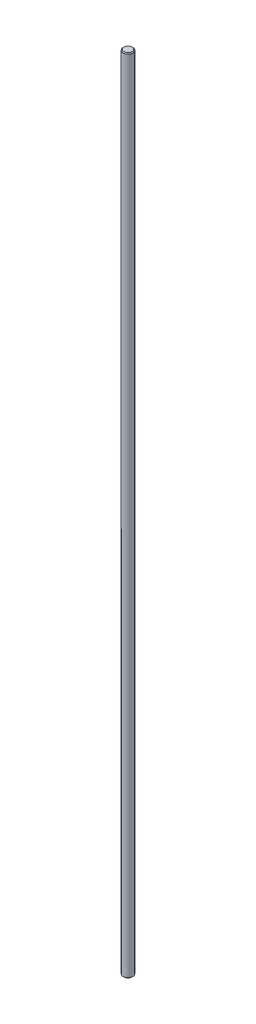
ISO-10303-21;
HEADER;
FILE_DESCRIPTION(('STEP AP214'),'2;1');
FILE_NAME('part.step','',(''),(''),'','','');
FILE_SCHEMA(('AUTOMOTIVE_DESIGN { 1 0 10303 214 1 1 1 1 }'));
ENDSEC;
DATA;
#1=APPLICATION_CONTEXT('core data for automotive mechanical design processes');
#2=APPLICATION_PROTOCOL_DEFINITION('international standard','automotive_design',2000,#1);
#3=PRODUCT_CONTEXT('',#1,'mechanical');
#4=PRODUCT('Part','Part','',(#3));
#5=PRODUCT_RELATED_PRODUCT_CATEGORY('part','',(#4));
#6=PRODUCT_DEFINITION_FORMATION('','',#4);
#7=PRODUCT_DEFINITION_CONTEXT('part definition',#1,'design');
#8=PRODUCT_DEFINITION('design','',#6,#7);
#9=PRODUCT_DEFINITION_SHAPE('','',#8);
#10=(LENGTH_UNIT() NAMED_UNIT(*) SI_UNIT(.MILLI.,.METRE.));
#11=(NAMED_UNIT(*) PLANE_ANGLE_UNIT() SI_UNIT($,.RADIAN.));
#12=(NAMED_UNIT(*) SI_UNIT($,.STERADIAN.) SOLID_ANGLE_UNIT());
#13=UNCERTAINTY_MEASURE_WITH_UNIT(LENGTH_MEASURE(1.E-05),#10,'distance_accuracy_value','');
#14=(GEOMETRIC_REPRESENTATION_CONTEXT(3) GLOBAL_UNCERTAINTY_ASSIGNED_CONTEXT((#13)) GLOBAL_UNIT_ASSIGNED_CONTEXT((#10,
#11,#12)) REPRESENTATION_CONTEXT('',''));
#15=CARTESIAN_POINT('',(0.,0.,0.));
#16=DIRECTION('',(0.,0.,1.));
#17=DIRECTION('',(1.,0.,0.));
#18=AXIS2_PLACEMENT_3D('',#15,#16,#17);
#19=CARTESIAN_POINT('',(0.,500.,0.));
#20=DIRECTION('',(0.,-1.,0.));
#21=DIRECTION('',(0.,0.,-1.));
#22=AXIS2_PLACEMENT_3D('',#19,#20,#21);
#23=CYLINDRICAL_SURFACE('',#22,3.);
#24=CARTESIAN_POINT('',(0.,499.5,0.));
#25=DIRECTION('',(0.,1.,0.));
#26=DIRECTION('',(0.,0.,1.));
#27=AXIS2_PLACEMENT_3D('',#24,#25,#26);
#28=CIRCLE('',#27,3.);
#29=CARTESIAN_POINT('',(0.,499.5,3.));
#30=VERTEX_POINT('',#29);
#31=EDGE_CURVE('E30',#30,#30,#28,.F.);
#32=ORIENTED_EDGE('',*,*,#31,.T.);
#33=EDGE_LOOP('',(#32));
#34=FACE_BOUND('',#33,.T.);
#35=CARTESIAN_POINT('',(0.,0.499999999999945,0.));
#36=DIRECTION('',(0.,1.,0.));
#37=DIRECTION('',(0.,0.,1.));
#38=AXIS2_PLACEMENT_3D('',#35,#36,#37);
#39=CIRCLE('',#38,3.);
#40=CARTESIAN_POINT('',(0.,0.499999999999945,3.));
#41=VERTEX_POINT('',#40);
#42=EDGE_CURVE('E34',#41,#41,#39,.T.);
#43=ORIENTED_EDGE('',*,*,#42,.T.);
#44=EDGE_LOOP('',(#43));
#45=FACE_BOUND('',#44,.T.);
#46=ADVANCED_FACE('F24',(#34,#45),#23,.T.);
#47=CARTESIAN_POINT('',(0.,500.,0.));
#48=DIRECTION('',(0.,1.,0.));
#49=DIRECTION('',(0.,0.,1.));
#50=AXIS2_PLACEMENT_3D('',#47,#48,#49);
#51=PLANE('',#50);
#52=CARTESIAN_POINT('',(0.,500.,0.));
#53=DIRECTION('',(0.,1.,0.));
#54=DIRECTION('',(0.,0.,1.));
#55=AXIS2_PLACEMENT_3D('',#52,#53,#54);
#56=CIRCLE('',#55,2.50000000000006);
#57=CARTESIAN_POINT('',(0.,500.,2.50000000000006));
#58=VERTEX_POINT('',#57);
#59=EDGE_CURVE('E38',#58,#58,#56,.T.);
#60=ORIENTED_EDGE('',*,*,#59,.T.);
#61=EDGE_LOOP('',(#60));
#62=FACE_BOUND('',#61,.T.);
#63=ADVANCED_FACE('F44',(#62),#51,.T.);
#64=CARTESIAN_POINT('',(0.,0.,0.));
#65=DIRECTION('',(0.,1.,0.));
#66=DIRECTION('',(0.,0.,1.));
#67=AXIS2_PLACEMENT_3D('',#64,#65,#66);
#68=PLANE('',#67);
#69=CARTESIAN_POINT('',(0.,0.,0.));
#70=DIRECTION('',(0.,1.,0.));
#71=DIRECTION('',(0.,0.,1.));
#72=AXIS2_PLACEMENT_3D('',#69,#70,#71);
#73=CIRCLE('',#72,2.50000000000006);
#74=CARTESIAN_POINT('',(0.,0.,2.50000000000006));
#75=VERTEX_POINT('',#74);
#76=EDGE_CURVE('E10',#75,#75,#73,.F.);
#77=ORIENTED_EDGE('',*,*,#76,.T.);
#78=EDGE_LOOP('',(#77));
#79=FACE_BOUND('',#78,.T.);
#80=ADVANCED_FACE('F49',(#79),#68,.F.);
#81=CARTESIAN_POINT('',(0.,500.,0.));
#82=DIRECTION('',(0.,-1.,0.));
#83=DIRECTION('',(0.,0.,-1.));
#84=AXIS2_PLACEMENT_3D('',#81,#82,#83);
#85=CONICAL_SURFACE('',#84,2.50000000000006,0.785398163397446);
#86=ORIENTED_EDGE('',*,*,#31,.F.);
#87=EDGE_LOOP('',(#86));
#88=FACE_BOUND('',#87,.T.);
#89=ORIENTED_EDGE('',*,*,#59,.F.);
#90=EDGE_LOOP('',(#89));
#91=FACE_BOUND('',#90,.T.);
#92=ADVANCED_FACE('F46',(#88,#91),#85,.T.);
#93=CARTESIAN_POINT('',(0.,0.499999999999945,0.));
#94=DIRECTION('',(0.,1.,0.));
#95=DIRECTION('',(0.,0.,1.));
#96=AXIS2_PLACEMENT_3D('',#93,#94,#95);
#97=CONICAL_SURFACE('',#96,3.,0.785398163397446);
#98=ORIENTED_EDGE('',*,*,#76,.F.);
#99=EDGE_LOOP('',(#98));
#100=FACE_BOUND('',#99,.T.);
#101=ORIENTED_EDGE('',*,*,#42,.F.);
#102=EDGE_LOOP('',(#101));
#103=FACE_BOUND('',#102,.T.);
#104=ADVANCED_FACE('F48',(#100,#103),#97,.T.);
#105=CLOSED_SHELL('',(#46,#63,#80,#92,#104));
#106=MANIFOLD_SOLID_BREP('B2',#105);
#107=ADVANCED_BREP_SHAPE_REPRESENTATION('',(#18,#106),#14);
#108=SHAPE_DEFINITION_REPRESENTATION(#9,#107);
ENDSEC;
END-ISO-10303-21;
